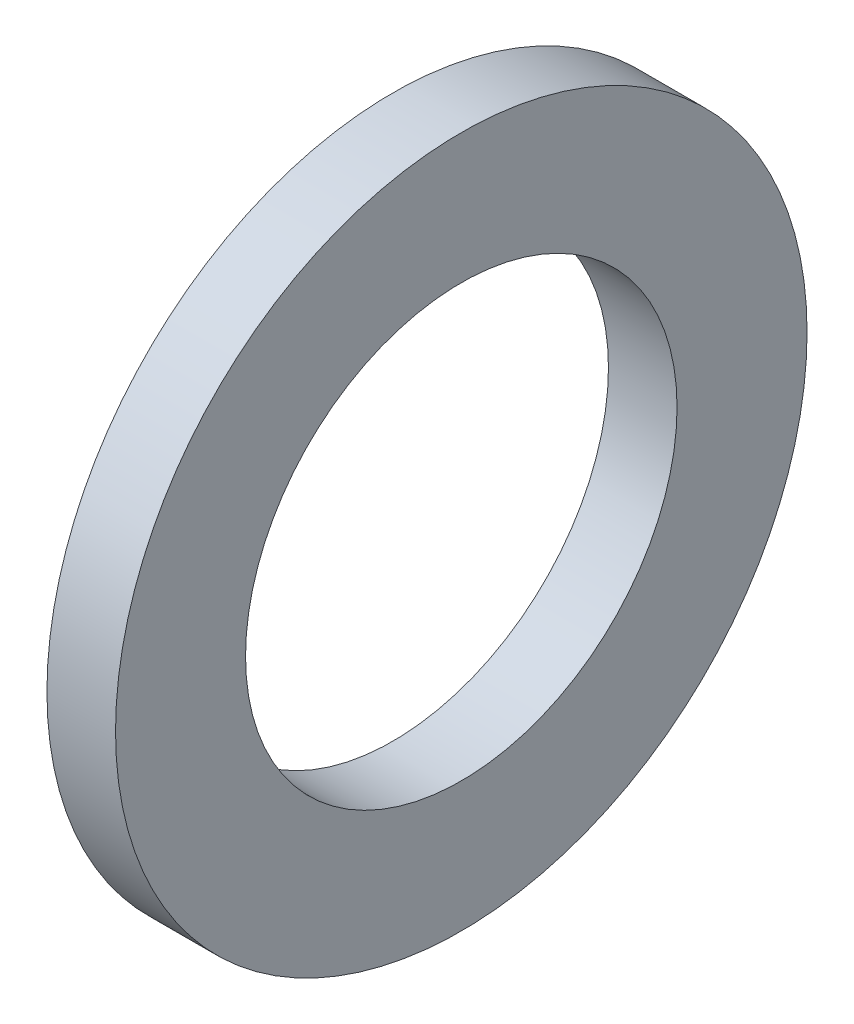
from build123d import *

# Parameters (mm, degrees)
SKETCH1_W = 1.5748
SKETCH1_H = 2.9845


with BuildPart() as part:
    # Sketch1 → Revolve1 (revolve)
    with BuildSketch(Plane.XY, mode=Mode.PRIVATE) as revolve1_sk:
        with Locations((0.7874, 6.44525)):
            Rectangle(SKETCH1_W, SKETCH1_H)
    revolve(revolve1_sk.sketch.rotate(Axis((0, 0, 0), (1, 0, 0)), 90), axis=Axis((0, 0, 0), (1, 0, 0)))


solid = part.part
